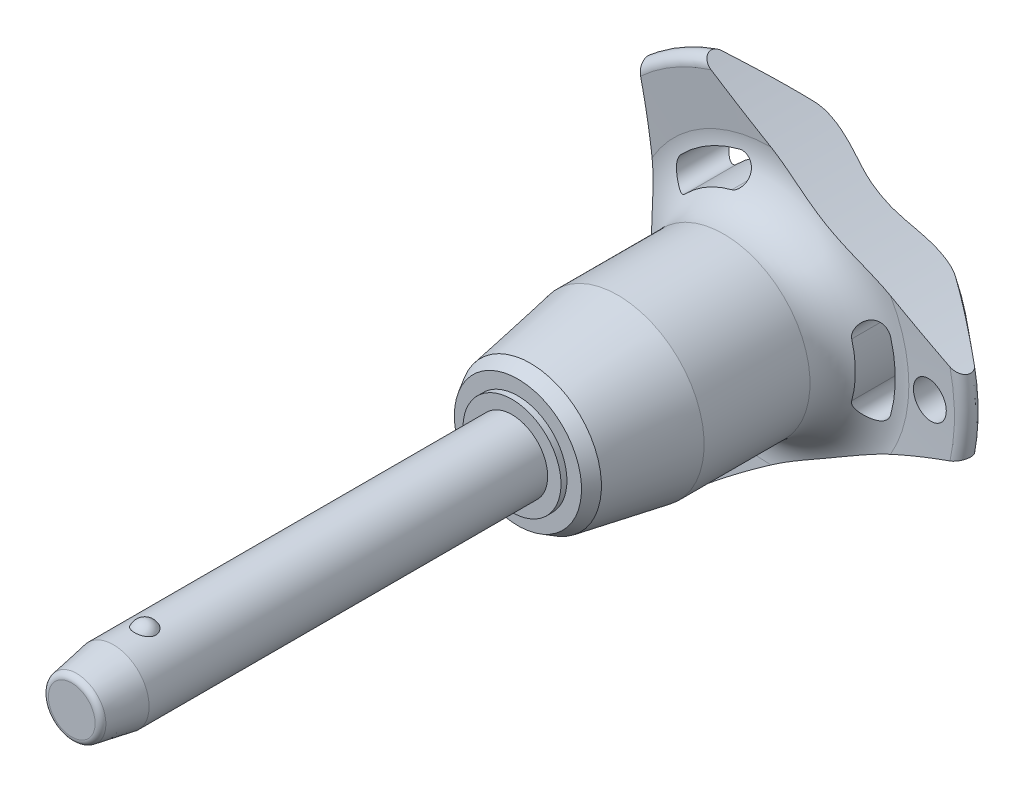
from build123d import *

# Parameters (mm, degrees)
SKETCH1_R           = 3
BOSS_EXTRUDE1_DEPTH = 30
SKETCH2_R           = 2.5
BOSS_EXTRUDE2_DEPTH = 26.7
BOSS_EXTRUDE3_START = 7
SKETCH1_2_R         = 3
BOSS_EXTRUDE3_DEPTH = 7
CHAMFER1_SIZE       = 3.5
CHAMFER1_SIZE2      = 0.617144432
FILLET1_R           = 0.5
SKETCH6_R           = 79.96
CUT_EXTRUDE1_DEPTH  = 62.368512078
CIRPATTERN1_COUNT   = 3
SKETCH7_R           = 1.5
CUT_EXTRUDE2_DEPTH  = 62.119983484


with BuildPart() as part:
    # Sketch1 → Boss-Extrude1 (new body)
    with BuildSketch(Plane.XY):
        Circle(SKETCH1_R)
    extrude(amount=-BOSS_EXTRUDE1_DEPTH)

    # Sketch2 → Boss-Extrude2 (add)
    with BuildSketch(Plane(origin=(0, 0, -30), x_dir=(-1, 0, 0), z_dir=(0, 0, -1))):
        Circle(SKETCH2_R)
    extrude(amount=BOSS_EXTRUDE2_DEPTH)

    # Sketch3 → Revolve1 (revolve)
    with BuildSketch(Plane(origin=(0, 0, 0), x_dir=(0, 0, -1), z_dir=(1, 0, 0))):
        with BuildLine():
            Line((-0.866025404, 3.5), (-0.866025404, 1.5))
            ThreePointArc((-0.866025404, 1.5), (0.133974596, 2.5), (-0.866025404, 3.5))
        make_face()
        with BuildLine():
            Line((-0.866025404, -1.5), (-0.866025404, -3.5))
            ThreePointArc((-0.866025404, -3.5), (0.133974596, -2.5), (-0.866025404, -1.5))
        make_face()
    revolve(axis=Axis((0, -1.5, 0.866025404), (0, 1, 0)))

    # Sketch1_2 → Boss-Extrude3 (add)
    with BuildSketch(Plane.XY.offset(BOSS_EXTRUDE3_START)):
        Circle(SKETCH1_2_R)
    extrude(amount=-BOSS_EXTRUDE3_DEPTH)

    # Chamfer1
    chamfer1_edges = [part.edges().sort_by_distance(p)[0] for p in [
        (-3, 0, 7),
    ]]
    chamfer1_side = [part.faces().sort_by_distance(p)[0] for p in [
        (-3, 0, -11.5),
    ]]
    chamfer(chamfer1_edges, length=CHAMFER1_SIZE, length2=CHAMFER1_SIZE2, reference=chamfer1_side[0])

    # Fillet1
    fillet1_edges = [part.edges().sort_by_distance(p)[0] for p in [
        (-2.382855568, 0, 7),
        (2.5, 0, -56.7),
    ]]
    fillet(fillet1_edges, radius=FILLET1_R)

    # Sketch4 → Revolve2 (revolve)
    with BuildSketch(Plane(origin=(0, 0, 0), x_dir=(0, 0, -1), z_dir=(1, 0, 0)), mode=Mode.PRIVATE) as revolve2_sk:
        Polygon((30, 0), (30, 4.118359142), (30.5, 4.118359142), (30.5, 5.343400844), (31.560917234, 5.955921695), (38.9, 7.25), (47.8, 7.25), (47.8, 0), align=None)
    revolve(revolve2_sk.sketch.rotate(Axis((0, 0, -47.8), (0, 0, 1)), 90), axis=Axis((0, 0, -47.8), (0, 0, 1)))

    # Sketch5 → Revolve3 (revolve)
    with BuildSketch(Plane(origin=(0, 0, 0), x_dir=(0, 0, -1), z_dir=(1, 0, 0)), mode=Mode.PRIVATE) as revolve3_sk:
        with BuildLine():
            Line((51.78715932, 11.570250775), (51.452568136, 15.735949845))
            ThreePointArc((51.452568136, 15.735949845), (51.946485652, 16.540188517), (52.862835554, 16.314230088))
            Line((52.862835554, 16.314230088), (56.326414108, 12.186497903))
            ThreePointArc((56.326414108, 12.186497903), (56.7, 11.109282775), (56.261488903, 10.056825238))
            ThreePointArc((56.261488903, 10.056825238), (53.289873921, 5.413681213), (52.25, 0))
            Line((52.25, 0), (47.8, 0))
            Line((47.8, 0), (47.8, 7.25))
            ThreePointArc((47.8, 7.25), (50.739473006, 8.537160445), (51.78715932, 11.570250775))
        make_face()
    revolve(revolve3_sk.sketch.rotate(Axis((0, 0, -52.25), (0, 0, 1)), 90), axis=Axis((0, 0, -52.25), (0, 0, 1)))

    # Sketch6 → Cut-Extrude1 (cut, through all)
    with BuildSketch(Plane.XY):
        with Locations((-89.76, 0)):
            Circle(SKETCH6_R)
        with BuildLine():
            ThreePointArc((10.099921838, -2.834717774), (10.490188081, 0), (10.099921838, 2.834717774))
            ThreePointArc((10.099921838, 2.834717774), (8.768180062, 3.582738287), (8.020159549, 2.250996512))
            ThreePointArc((8.020159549, 2.250996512), (8.330062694, 0), (8.020159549, -2.250996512))
            ThreePointArc((8.020159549, -2.250996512), (8.768180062, -3.582738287), (10.099921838, -2.834717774))
        make_face()
    cut_extrude1 = extrude(amount=-CUT_EXTRUDE1_DEPTH, mode=Mode.SUBTRACT)

    # CirPattern1: Cut-Extrude1 ×3 about axis
    cirpattern1_axis = Axis((0, 0, 0), (0, 0, 1))
    for i in range(1, CIRPATTERN1_COUNT):
        add(cut_extrude1.rotate(cirpattern1_axis, i * 360 / CIRPATTERN1_COUNT), mode=Mode.SUBTRACT)

    # Sketch7 → Cut-Extrude2 (cut, through all)
    with BuildSketch(Plane.XY):
        with Locations(Location((13.490188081, 0, 0), (0, 0, 225.221865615))):
            Circle(SKETCH7_R)
    extrude(amount=-CUT_EXTRUDE2_DEPTH, mode=Mode.SUBTRACT)


solid = part.part
